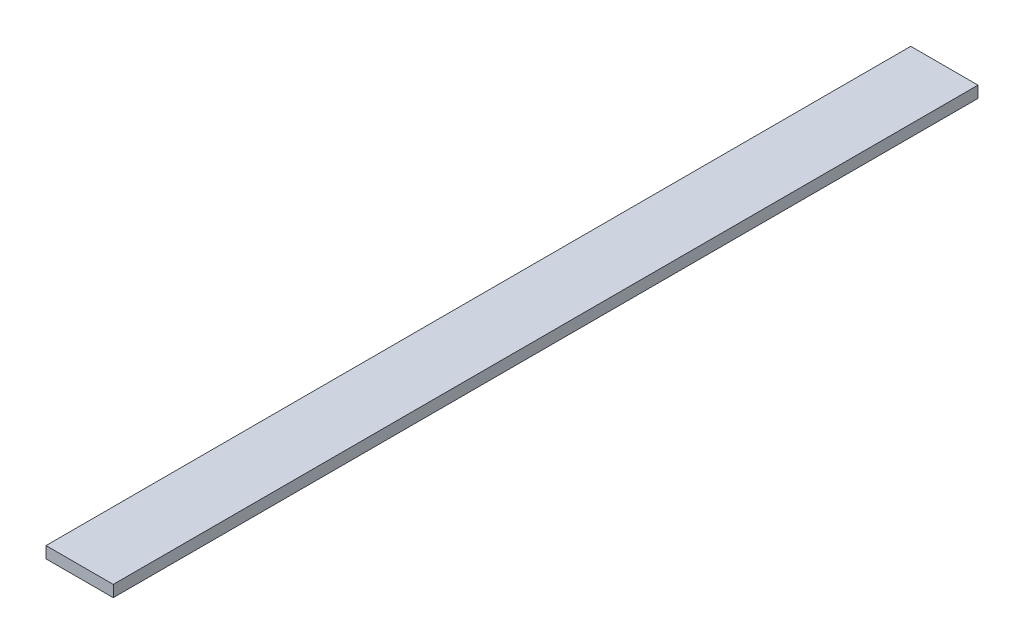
ISO-10303-21;
HEADER;
FILE_DESCRIPTION(('STEP AP214'),'2;1');
FILE_NAME('part.step','',(''),(''),'','','');
FILE_SCHEMA(('AUTOMOTIVE_DESIGN { 1 0 10303 214 1 1 1 1 }'));
ENDSEC;
DATA;
#1=APPLICATION_CONTEXT('core data for automotive mechanical design processes');
#2=APPLICATION_PROTOCOL_DEFINITION('international standard','automotive_design',2000,#1);
#3=PRODUCT_CONTEXT('',#1,'mechanical');
#4=PRODUCT('Part','Part','',(#3));
#5=PRODUCT_RELATED_PRODUCT_CATEGORY('part','',(#4));
#6=PRODUCT_DEFINITION_FORMATION('','',#4);
#7=PRODUCT_DEFINITION_CONTEXT('part definition',#1,'design');
#8=PRODUCT_DEFINITION('design','',#6,#7);
#9=PRODUCT_DEFINITION_SHAPE('','',#8);
#10=(LENGTH_UNIT() NAMED_UNIT(*) SI_UNIT(.MILLI.,.METRE.));
#11=(NAMED_UNIT(*) PLANE_ANGLE_UNIT() SI_UNIT($,.RADIAN.));
#12=(NAMED_UNIT(*) SI_UNIT($,.STERADIAN.) SOLID_ANGLE_UNIT());
#13=UNCERTAINTY_MEASURE_WITH_UNIT(LENGTH_MEASURE(1.E-05),#10,'distance_accuracy_value','');
#14=(GEOMETRIC_REPRESENTATION_CONTEXT(3) GLOBAL_UNCERTAINTY_ASSIGNED_CONTEXT((#13)) GLOBAL_UNIT_ASSIGNED_CONTEXT((#10,
#11,#12)) REPRESENTATION_CONTEXT('',''));
#15=CARTESIAN_POINT('',(0.,0.,0.));
#16=DIRECTION('',(0.,0.,1.));
#17=DIRECTION('',(1.,0.,0.));
#18=AXIS2_PLACEMENT_3D('',#15,#16,#17);
#19=CARTESIAN_POINT('',(-17.5,3.,225.));
#20=DIRECTION('',(1.,0.,0.));
#21=DIRECTION('',(0.,0.,-1.));
#22=AXIS2_PLACEMENT_3D('',#19,#20,#21);
#23=PLANE('',#22);
#24=DIRECTION('',(0.,-1.,0.));
#25=VECTOR('',#24,1.);
#26=CARTESIAN_POINT('',(-17.5,3.,-225.));
#27=LINE('',#26,#25);
#28=CARTESIAN_POINT('',(-17.5,3.,-225.));
#29=VERTEX_POINT('',#28);
#30=CARTESIAN_POINT('',(-17.5,-3.,-225.));
#31=VERTEX_POINT('',#30);
#32=EDGE_CURVE('E98',#29,#31,#27,.T.);
#33=ORIENTED_EDGE('',*,*,#32,.T.);
#34=DIRECTION('',(0.,0.,-1.));
#35=VECTOR('',#34,1.);
#36=CARTESIAN_POINT('',(-17.5,-3.,225.));
#37=LINE('',#36,#35);
#38=CARTESIAN_POINT('',(-17.5,-3.,225.));
#39=VERTEX_POINT('',#38);
#40=EDGE_CURVE('E11',#39,#31,#37,.T.);
#41=ORIENTED_EDGE('',*,*,#40,.F.);
#42=DIRECTION('',(0.,-1.,0.));
#43=VECTOR('',#42,1.);
#44=CARTESIAN_POINT('',(-17.5,3.,225.));
#45=LINE('',#44,#43);
#46=CARTESIAN_POINT('',(-17.5,3.,225.));
#47=VERTEX_POINT('',#46);
#48=EDGE_CURVE('E86',#47,#39,#45,.T.);
#49=ORIENTED_EDGE('',*,*,#48,.F.);
#50=DIRECTION('',(0.,0.,-1.));
#51=VECTOR('',#50,1.);
#52=CARTESIAN_POINT('',(-17.5,3.,225.));
#53=LINE('',#52,#51);
#54=EDGE_CURVE('E94',#47,#29,#53,.T.);
#55=ORIENTED_EDGE('',*,*,#54,.T.);
#56=EDGE_LOOP('',(#33,#41,#49,#55));
#57=FACE_BOUND('',#56,.T.);
#58=ADVANCED_FACE('F35',(#57),#23,.F.);
#59=CARTESIAN_POINT('',(-17.5,-3.,225.));
#60=DIRECTION('',(0.,1.,0.));
#61=DIRECTION('',(0.,0.,1.));
#62=AXIS2_PLACEMENT_3D('',#59,#60,#61);
#63=PLANE('',#62);
#64=DIRECTION('',(1.,0.,0.));
#65=VECTOR('',#64,1.);
#66=CARTESIAN_POINT('',(-17.5,-3.,-225.));
#67=LINE('',#66,#65);
#68=CARTESIAN_POINT('',(17.5,-3.,-225.));
#69=VERTEX_POINT('',#68);
#70=EDGE_CURVE('E90',#31,#69,#67,.T.);
#71=ORIENTED_EDGE('',*,*,#70,.T.);
#72=DIRECTION('',(0.,0.,-1.));
#73=VECTOR('',#72,1.);
#74=CARTESIAN_POINT('',(17.5,-3.,225.));
#75=LINE('',#74,#73);
#76=CARTESIAN_POINT('',(17.5,-3.,225.));
#77=VERTEX_POINT('',#76);
#78=EDGE_CURVE('E43',#77,#69,#75,.T.);
#79=ORIENTED_EDGE('',*,*,#78,.F.);
#80=DIRECTION('',(1.,0.,0.));
#81=VECTOR('',#80,1.);
#82=CARTESIAN_POINT('',(-17.5,-3.,225.));
#83=LINE('',#82,#81);
#84=EDGE_CURVE('E81',#39,#77,#83,.T.);
#85=ORIENTED_EDGE('',*,*,#84,.F.);
#86=ORIENTED_EDGE('',*,*,#40,.T.);
#87=EDGE_LOOP('',(#71,#79,#85,#86));
#88=FACE_BOUND('',#87,.T.);
#89=ADVANCED_FACE('F89',(#88),#63,.F.);
#90=CARTESIAN_POINT('',(17.5,3.,225.));
#91=DIRECTION('',(-1.,0.,0.));
#92=DIRECTION('',(0.,-1.,0.));
#93=AXIS2_PLACEMENT_3D('',#90,#91,#92);
#94=PLANE('',#93);
#95=DIRECTION('',(0.,1.,0.));
#96=VECTOR('',#95,1.);
#97=CARTESIAN_POINT('',(17.5,3.,-225.));
#98=LINE('',#97,#96);
#99=CARTESIAN_POINT('',(17.5,3.,-225.));
#100=VERTEX_POINT('',#99);
#101=EDGE_CURVE('E68',#69,#100,#98,.T.);
#102=ORIENTED_EDGE('',*,*,#101,.T.);
#103=DIRECTION('',(0.,0.,-1.));
#104=VECTOR('',#103,1.);
#105=CARTESIAN_POINT('',(17.5,3.,225.));
#106=LINE('',#105,#104);
#107=CARTESIAN_POINT('',(17.5,3.,225.));
#108=VERTEX_POINT('',#107);
#109=EDGE_CURVE('E91',#108,#100,#106,.T.);
#110=ORIENTED_EDGE('',*,*,#109,.F.);
#111=DIRECTION('',(0.,1.,0.));
#112=VECTOR('',#111,1.);
#113=CARTESIAN_POINT('',(17.5,3.,225.));
#114=LINE('',#113,#112);
#115=EDGE_CURVE('E84',#77,#108,#114,.T.);
#116=ORIENTED_EDGE('',*,*,#115,.F.);
#117=ORIENTED_EDGE('',*,*,#78,.T.);
#118=EDGE_LOOP('',(#102,#110,#116,#117));
#119=FACE_BOUND('',#118,.T.);
#120=ADVANCED_FACE('F92',(#119),#94,.F.);
#121=CARTESIAN_POINT('',(-17.5,3.,225.));
#122=DIRECTION('',(0.,-1.,0.));
#123=DIRECTION('',(0.,0.,-1.));
#124=AXIS2_PLACEMENT_3D('',#121,#122,#123);
#125=PLANE('',#124);
#126=DIRECTION('',(-1.,0.,0.));
#127=VECTOR('',#126,1.);
#128=CARTESIAN_POINT('',(-17.5,3.,-225.));
#129=LINE('',#128,#127);
#130=EDGE_CURVE('E74',#100,#29,#129,.T.);
#131=ORIENTED_EDGE('',*,*,#130,.T.);
#132=ORIENTED_EDGE('',*,*,#54,.F.);
#133=DIRECTION('',(-1.,0.,0.));
#134=VECTOR('',#133,1.);
#135=CARTESIAN_POINT('',(-17.5,3.,225.));
#136=LINE('',#135,#134);
#137=EDGE_CURVE('E51',#108,#47,#136,.T.);
#138=ORIENTED_EDGE('',*,*,#137,.F.);
#139=ORIENTED_EDGE('',*,*,#109,.T.);
#140=EDGE_LOOP('',(#131,#132,#138,#139));
#141=FACE_BOUND('',#140,.T.);
#142=ADVANCED_FACE('F105',(#141),#125,.F.);
#143=CARTESIAN_POINT('',(-17.5,-3.,225.));
#144=DIRECTION('',(0.,0.,1.));
#145=DIRECTION('',(1.,0.,0.));
#146=AXIS2_PLACEMENT_3D('',#143,#144,#145);
#147=PLANE('',#146);
#148=ORIENTED_EDGE('',*,*,#48,.T.);
#149=ORIENTED_EDGE('',*,*,#84,.T.);
#150=ORIENTED_EDGE('',*,*,#115,.T.);
#151=ORIENTED_EDGE('',*,*,#137,.T.);
#152=EDGE_LOOP('',(#148,#149,#150,#151));
#153=FACE_BOUND('',#152,.T.);
#154=ADVANCED_FACE('F82',(#153),#147,.T.);
#155=CARTESIAN_POINT('',(-17.5,-3.,-225.));
#156=DIRECTION('',(0.,0.,1.));
#157=DIRECTION('',(1.,0.,0.));
#158=AXIS2_PLACEMENT_3D('',#155,#156,#157);
#159=PLANE('',#158);
#160=ORIENTED_EDGE('',*,*,#32,.F.);
#161=ORIENTED_EDGE('',*,*,#130,.F.);
#162=ORIENTED_EDGE('',*,*,#101,.F.);
#163=ORIENTED_EDGE('',*,*,#70,.F.);
#164=EDGE_LOOP('',(#160,#161,#162,#163));
#165=FACE_BOUND('',#164,.T.);
#166=ADVANCED_FACE('F108',(#165),#159,.F.);
#167=CLOSED_SHELL('',(#58,#89,#120,#142,#154,#166));
#168=MANIFOLD_SOLID_BREP('B2',#167);
#169=ADVANCED_BREP_SHAPE_REPRESENTATION('',(#18,#168),#14);
#170=SHAPE_DEFINITION_REPRESENTATION(#9,#169);
ENDSEC;
END-ISO-10303-21;
